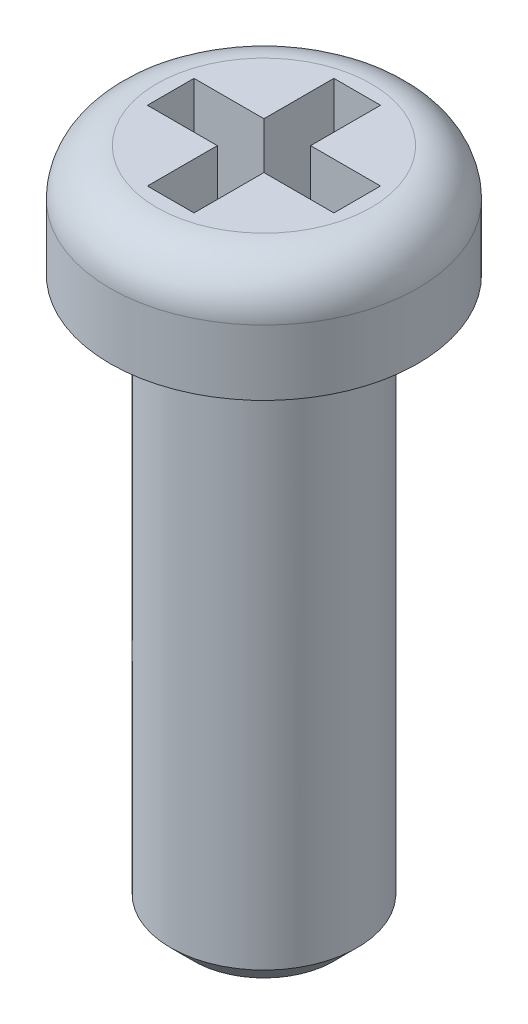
ISO-10303-21;
HEADER;
FILE_DESCRIPTION(('STEP AP214'),'2;1');
FILE_NAME('part.step','',(''),(''),'','','');
FILE_SCHEMA(('AUTOMOTIVE_DESIGN { 1 0 10303 214 1 1 1 1 }'));
ENDSEC;
DATA;
#1=APPLICATION_CONTEXT('core data for automotive mechanical design processes');
#2=APPLICATION_PROTOCOL_DEFINITION('international standard','automotive_design',2000,#1);
#3=PRODUCT_CONTEXT('',#1,'mechanical');
#4=PRODUCT('Part','Part','',(#3));
#5=PRODUCT_RELATED_PRODUCT_CATEGORY('part','',(#4));
#6=PRODUCT_DEFINITION_FORMATION('','',#4);
#7=PRODUCT_DEFINITION_CONTEXT('part definition',#1,'design');
#8=PRODUCT_DEFINITION('design','',#6,#7);
#9=PRODUCT_DEFINITION_SHAPE('','',#8);
#10=(LENGTH_UNIT() NAMED_UNIT(*) SI_UNIT(.MILLI.,.METRE.));
#11=(NAMED_UNIT(*) PLANE_ANGLE_UNIT() SI_UNIT($,.RADIAN.));
#12=(NAMED_UNIT(*) SI_UNIT($,.STERADIAN.) SOLID_ANGLE_UNIT());
#13=UNCERTAINTY_MEASURE_WITH_UNIT(LENGTH_MEASURE(1.E-05),#10,'distance_accuracy_value','');
#14=(GEOMETRIC_REPRESENTATION_CONTEXT(3) GLOBAL_UNCERTAINTY_ASSIGNED_CONTEXT((#13)) GLOBAL_UNIT_ASSIGNED_CONTEXT((#10,
#11,#12)) REPRESENTATION_CONTEXT('',''));
#15=CARTESIAN_POINT('',(0.,0.,0.));
#16=DIRECTION('',(0.,0.,1.));
#17=DIRECTION('',(1.,0.,0.));
#18=AXIS2_PLACEMENT_3D('',#15,#16,#17);
#19=CARTESIAN_POINT('',(1.64999999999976,0.,0.));
#20=DIRECTION('',(0.,1.,0.));
#21=DIRECTION('',(0.,0.,1.));
#22=AXIS2_PLACEMENT_3D('',#19,#20,#21);
#23=PLANE('',#22);
#24=CARTESIAN_POINT('',(0.,0.,0.));
#25=DIRECTION('',(0.,1.,0.));
#26=DIRECTION('',(0.,0.,1.));
#27=AXIS2_PLACEMENT_3D('',#24,#25,#26);
#28=CIRCLE('',#27,1.2);
#29=CARTESIAN_POINT('',(0.,0.,1.2));
#30=VERTEX_POINT('',#29);
#31=EDGE_CURVE('E222',#30,#30,#28,.T.);
#32=ORIENTED_EDGE('',*,*,#31,.T.);
#33=EDGE_LOOP('',(#32));
#34=FACE_BOUND('',#33,.T.);
#35=CARTESIAN_POINT('',(0.,0.,0.));
#36=DIRECTION('',(0.,1.,0.));
#37=DIRECTION('',(0.,0.,1.));
#38=AXIS2_PLACEMENT_3D('',#35,#36,#37);
#39=CIRCLE('',#38,1.65);
#40=CARTESIAN_POINT('',(0.,0.,1.65));
#41=VERTEX_POINT('',#40);
#42=EDGE_CURVE('E216',#41,#41,#39,.T.);
#43=ORIENTED_EDGE('',*,*,#42,.F.);
#44=EDGE_LOOP('',(#43));
#45=FACE_BOUND('',#44,.T.);
#46=ADVANCED_FACE('F44',(#34,#45),#23,.F.);
#47=CARTESIAN_POINT('',(0.249999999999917,0.199999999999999,1.00000000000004));
#48=DIRECTION('',(1.,0.,0.));
#49=DIRECTION('',(0.,0.,-1.));
#50=AXIS2_PLACEMENT_3D('',#47,#48,#49);
#51=PLANE('',#50);
#52=DIRECTION('',(0.,1.,0.));
#53=VECTOR('',#52,1.);
#54=CARTESIAN_POINT('',(0.249999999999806,0.199999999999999,0.250000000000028));
#55=LINE('',#54,#53);
#56=CARTESIAN_POINT('',(0.249999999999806,0.199999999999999,0.250000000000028));
#57=VERTEX_POINT('',#56);
#58=CARTESIAN_POINT('',(0.249999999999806,1.2,0.250000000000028));
#59=VERTEX_POINT('',#58);
#60=EDGE_CURVE('E166',#57,#59,#55,.T.);
#61=ORIENTED_EDGE('',*,*,#60,.F.);
#62=DIRECTION('',(0.,0.,-1.));
#63=VECTOR('',#62,1.);
#64=CARTESIAN_POINT('',(0.249999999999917,0.199999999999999,1.00000000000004));
#65=LINE('',#64,#63);
#66=CARTESIAN_POINT('',(0.249999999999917,0.199999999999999,1.00000000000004));
#67=VERTEX_POINT('',#66);
#68=EDGE_CURVE('E175',#67,#57,#65,.T.);
#69=ORIENTED_EDGE('',*,*,#68,.F.);
#70=DIRECTION('',(0.,1.,0.));
#71=VECTOR('',#70,1.);
#72=CARTESIAN_POINT('',(0.249999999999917,0.199999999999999,1.00000000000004));
#73=LINE('',#72,#71);
#74=CARTESIAN_POINT('',(0.249999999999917,1.2,1.00000000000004));
#75=VERTEX_POINT('',#74);
#76=EDGE_CURVE('E201',#67,#75,#73,.T.);
#77=ORIENTED_EDGE('',*,*,#76,.T.);
#78=DIRECTION('',(0.,0.,-1.));
#79=VECTOR('',#78,1.);
#80=CARTESIAN_POINT('',(0.249999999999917,1.2,1.00000000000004));
#81=LINE('',#80,#79);
#82=EDGE_CURVE('E188',#75,#59,#81,.T.);
#83=ORIENTED_EDGE('',*,*,#82,.T.);
#84=EDGE_LOOP('',(#61,#69,#77,#83));
#85=FACE_BOUND('',#84,.T.);
#86=ADVANCED_FACE('F238',(#85),#51,.F.);
#87=CARTESIAN_POINT('',(-0.250000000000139,0.199999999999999,1.00000000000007));
#88=DIRECTION('',(1.,0.,0.));
#89=DIRECTION('',(0.,0.,-1.));
#90=AXIS2_PLACEMENT_3D('',#87,#88,#89);
#91=PLANE('',#90);
#92=DIRECTION('',(0.,0.,-1.));
#93=VECTOR('',#92,1.);
#94=CARTESIAN_POINT('',(-0.250000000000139,0.199999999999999,1.00000000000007));
#95=LINE('',#94,#93);
#96=CARTESIAN_POINT('',(-0.250000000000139,0.199999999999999,1.00000000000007));
#97=VERTEX_POINT('',#96);
#98=CARTESIAN_POINT('',(-0.250000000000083,0.199999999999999,0.25000000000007));
#99=VERTEX_POINT('',#98);
#100=EDGE_CURVE('E182',#97,#99,#95,.T.);
#101=ORIENTED_EDGE('',*,*,#100,.T.);
#102=DIRECTION('',(0.,1.,0.));
#103=VECTOR('',#102,1.);
#104=CARTESIAN_POINT('',(-0.250000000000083,0.199999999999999,0.25000000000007));
#105=LINE('',#104,#103);
#106=CARTESIAN_POINT('',(-0.250000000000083,1.2,0.25000000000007));
#107=VERTEX_POINT('',#106);
#108=EDGE_CURVE('E163',#99,#107,#105,.T.);
#109=ORIENTED_EDGE('',*,*,#108,.T.);
#110=DIRECTION('',(0.,0.,-1.));
#111=VECTOR('',#110,1.);
#112=CARTESIAN_POINT('',(-0.250000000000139,1.2,1.00000000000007));
#113=LINE('',#112,#111);
#114=CARTESIAN_POINT('',(-0.250000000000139,1.2,1.00000000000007));
#115=VERTEX_POINT('',#114);
#116=EDGE_CURVE('E195',#115,#107,#113,.T.);
#117=ORIENTED_EDGE('',*,*,#116,.F.);
#118=DIRECTION('',(0.,1.,0.));
#119=VECTOR('',#118,1.);
#120=CARTESIAN_POINT('',(-0.250000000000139,0.199999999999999,1.00000000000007));
#121=LINE('',#120,#119);
#122=EDGE_CURVE('E204',#97,#115,#121,.T.);
#123=ORIENTED_EDGE('',*,*,#122,.F.);
#124=EDGE_LOOP('',(#101,#109,#117,#123));
#125=FACE_BOUND('',#124,.T.);
#126=ADVANCED_FACE('F244',(#125),#91,.T.);
#127=CARTESIAN_POINT('',(0.,11.592517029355,0.));
#128=DIRECTION('',(0.,1.,0.));
#129=DIRECTION('',(0.,0.,1.));
#130=AXIS2_PLACEMENT_3D('',#127,#128,#129);
#131=CYLINDRICAL_SURFACE('',#130,1.65);
#132=CARTESIAN_POINT('',(0.,0.699999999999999,0.));
#133=DIRECTION('',(0.,1.,0.));
#134=DIRECTION('',(0.,0.,1.));
#135=AXIS2_PLACEMENT_3D('',#132,#133,#134);
#136=CIRCLE('',#135,1.65);
#137=CARTESIAN_POINT('',(0.,0.699999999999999,1.65));
#138=VERTEX_POINT('',#137);
#139=EDGE_CURVE('E213',#138,#138,#136,.T.);
#140=ORIENTED_EDGE('',*,*,#139,.F.);
#141=EDGE_LOOP('',(#140));
#142=FACE_BOUND('',#141,.T.);
#143=ORIENTED_EDGE('',*,*,#42,.T.);
#144=EDGE_LOOP('',(#143));
#145=FACE_BOUND('',#144,.T.);
#146=ADVANCED_FACE('F250',(#142,#145),#131,.T.);
#147=CARTESIAN_POINT('',(0.,0.699999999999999,0.));
#148=DIRECTION('',(0.,1.,0.));
#149=DIRECTION('',(0.,0.,1.));
#150=AXIS2_PLACEMENT_3D('',#147,#148,#149);
#151=TOROIDAL_SURFACE('',#150,1.15,0.5);
#152=CARTESIAN_POINT('',(0.,1.2,0.));
#153=DIRECTION('',(0.,1.,0.));
#154=DIRECTION('',(0.,0.,1.));
#155=AXIS2_PLACEMENT_3D('',#152,#153,#154);
#156=CIRCLE('',#155,1.15);
#157=CARTESIAN_POINT('',(0.,1.2,1.15));
#158=VERTEX_POINT('',#157);
#159=EDGE_CURVE('E203',#158,#158,#156,.T.);
#160=ORIENTED_EDGE('',*,*,#159,.F.);
#161=EDGE_LOOP('',(#160));
#162=FACE_BOUND('',#161,.T.);
#163=ORIENTED_EDGE('',*,*,#139,.T.);
#164=EDGE_LOOP('',(#163));
#165=FACE_BOUND('',#164,.T.);
#166=ADVANCED_FACE('F253',(#162,#165),#151,.T.);
#167=CARTESIAN_POINT('',(0.,1.2,0.));
#168=DIRECTION('',(0.,-1.,0.));
#169=DIRECTION('',(0.,0.,-1.));
#170=AXIS2_PLACEMENT_3D('',#167,#168,#169);
#171=PLANE('',#170);
#172=CARTESIAN_POINT('',(0.24999999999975,1.2,-0.249999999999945));
#173=VERTEX_POINT('',#172);
#174=CARTESIAN_POINT('',(0.249999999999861,1.2,-0.999999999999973));
#175=VERTEX_POINT('',#174);
#176=EDGE_CURVE('E174',#173,#175,#81,.T.);
#177=ORIENTED_EDGE('',*,*,#176,.F.);
#178=DIRECTION('',(-1.,0.,0.));
#179=VECTOR('',#178,1.);
#180=CARTESIAN_POINT('',(0.999999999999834,1.2,-0.25));
#181=LINE('',#180,#179);
#182=CARTESIAN_POINT('',(0.999999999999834,1.2,-0.25));
#183=VERTEX_POINT('',#182);
#184=EDGE_CURVE('E410',#183,#173,#181,.T.);
#185=ORIENTED_EDGE('',*,*,#184,.F.);
#186=DIRECTION('',(0.,0.,1.));
#187=VECTOR('',#186,1.);
#188=CARTESIAN_POINT('',(0.999999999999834,1.2,-0.25));
#189=LINE('',#188,#187);
#190=CARTESIAN_POINT('',(0.999999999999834,1.2,0.250000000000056));
#191=VERTEX_POINT('',#190);
#192=EDGE_CURVE('E141',#183,#191,#189,.T.);
#193=ORIENTED_EDGE('',*,*,#192,.T.);
#194=DIRECTION('',(-1.,0.,0.));
#195=VECTOR('',#194,1.);
#196=CARTESIAN_POINT('',(0.999999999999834,1.2,0.250000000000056));
#197=LINE('',#196,#195);
#198=EDGE_CURVE('E395',#191,#59,#197,.T.);
#199=ORIENTED_EDGE('',*,*,#198,.T.);
#200=ORIENTED_EDGE('',*,*,#82,.F.);
#201=DIRECTION('',(-1.,0.,0.));
#202=VECTOR('',#201,1.);
#203=CARTESIAN_POINT('',(0.249999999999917,1.2,1.00000000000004));
#204=LINE('',#203,#202);
#205=EDGE_CURVE('E198',#75,#115,#204,.T.);
#206=ORIENTED_EDGE('',*,*,#205,.T.);
#207=ORIENTED_EDGE('',*,*,#116,.T.);
#208=CARTESIAN_POINT('',(-1.00000000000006,1.2,0.250000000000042));
#209=VERTEX_POINT('',#208);
#210=EDGE_CURVE('E401',#107,#209,#197,.T.);
#211=ORIENTED_EDGE('',*,*,#210,.T.);
#212=DIRECTION('',(0.,0.,-1.));
#213=VECTOR('',#212,1.);
#214=CARTESIAN_POINT('',(-1.00000000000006,1.2,0.250000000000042));
#215=LINE('',#214,#213);
#216=CARTESIAN_POINT('',(-1.00000000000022,1.2,-0.250000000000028));
#217=VERTEX_POINT('',#216);
#218=EDGE_CURVE('E405',#209,#217,#215,.T.);
#219=ORIENTED_EDGE('',*,*,#218,.T.);
#220=CARTESIAN_POINT('',(-0.25000000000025,1.2,-0.249999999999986));
#221=VERTEX_POINT('',#220);
#222=EDGE_CURVE('E154',#221,#217,#181,.T.);
#223=ORIENTED_EDGE('',*,*,#222,.F.);
#224=CARTESIAN_POINT('',(-0.250000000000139,1.2,-0.999999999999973));
#225=VERTEX_POINT('',#224);
#226=EDGE_CURVE('E194',#221,#225,#113,.T.);
#227=ORIENTED_EDGE('',*,*,#226,.T.);
#228=DIRECTION('',(1.,0.,0.));
#229=VECTOR('',#228,1.);
#230=CARTESIAN_POINT('',(-0.250000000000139,1.2,-0.999999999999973));
#231=LINE('',#230,#229);
#232=EDGE_CURVE('E191',#225,#175,#231,.T.);
#233=ORIENTED_EDGE('',*,*,#232,.T.);
#234=EDGE_LOOP('',(#177,#185,#193,#199,#200,#206,#207,#211,#219,#223,#227,#233));
#235=FACE_BOUND('',#234,.T.);
#236=ORIENTED_EDGE('',*,*,#159,.T.);
#237=EDGE_LOOP('',(#236));
#238=FACE_BOUND('',#237,.T.);
#239=ADVANCED_FACE('F257',(#235,#238),#171,.F.);
#240=CARTESIAN_POINT('',(0.24999999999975,0.199999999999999,-0.249999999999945));
#241=VERTEX_POINT('',#240);
#242=CARTESIAN_POINT('',(0.249999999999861,0.199999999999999,-0.999999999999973));
#243=VERTEX_POINT('',#242);
#244=EDGE_CURVE('E179',#241,#243,#65,.T.);
#245=ORIENTED_EDGE('',*,*,#244,.F.);
#246=DIRECTION('',(0.,1.,0.));
#247=VECTOR('',#246,1.);
#248=CARTESIAN_POINT('',(0.24999999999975,0.199999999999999,-0.249999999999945));
#249=LINE('',#248,#247);
#250=EDGE_CURVE('E171',#241,#173,#249,.T.);
#251=ORIENTED_EDGE('',*,*,#250,.T.);
#252=ORIENTED_EDGE('',*,*,#176,.T.);
#253=DIRECTION('',(0.,1.,0.));
#254=VECTOR('',#253,1.);
#255=CARTESIAN_POINT('',(0.249999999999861,0.199999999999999,-0.999999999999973));
#256=LINE('',#255,#254);
#257=EDGE_CURVE('E187',#243,#175,#256,.T.);
#258=ORIENTED_EDGE('',*,*,#257,.F.);
#259=EDGE_LOOP('',(#245,#251,#252,#258));
#260=FACE_BOUND('',#259,.T.);
#261=ADVANCED_FACE('F247',(#260),#51,.F.);
#262=CARTESIAN_POINT('',(0.249999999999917,0.199999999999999,1.00000000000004));
#263=DIRECTION('',(0.,0.,-1.));
#264=DIRECTION('',(-1.,0.,0.));
#265=AXIS2_PLACEMENT_3D('',#262,#263,#264);
#266=PLANE('',#265);
#267=ORIENTED_EDGE('',*,*,#205,.F.);
#268=ORIENTED_EDGE('',*,*,#76,.F.);
#269=DIRECTION('',(-1.,0.,0.));
#270=VECTOR('',#269,1.);
#271=CARTESIAN_POINT('',(0.249999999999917,0.199999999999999,1.00000000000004));
#272=LINE('',#271,#270);
#273=EDGE_CURVE('E185',#67,#97,#272,.T.);
#274=ORIENTED_EDGE('',*,*,#273,.T.);
#275=ORIENTED_EDGE('',*,*,#122,.T.);
#276=EDGE_LOOP('',(#267,#268,#274,#275));
#277=FACE_BOUND('',#276,.T.);
#278=ADVANCED_FACE('F263',(#277),#266,.T.);
#279=DIRECTION('',(0.,1.,0.));
#280=VECTOR('',#279,1.);
#281=CARTESIAN_POINT('',(-0.25000000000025,0.199999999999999,-0.249999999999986));
#282=LINE('',#281,#280);
#283=CARTESIAN_POINT('',(-0.25000000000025,0.199999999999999,-0.249999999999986));
#284=VERTEX_POINT('',#283);
#285=EDGE_CURVE('E169',#284,#221,#282,.T.);
#286=ORIENTED_EDGE('',*,*,#285,.F.);
#287=CARTESIAN_POINT('',(-0.250000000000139,0.199999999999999,-0.999999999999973));
#288=VERTEX_POINT('',#287);
#289=EDGE_CURVE('E137',#284,#288,#95,.T.);
#290=ORIENTED_EDGE('',*,*,#289,.T.);
#291=DIRECTION('',(0.,1.,0.));
#292=VECTOR('',#291,1.);
#293=CARTESIAN_POINT('',(-0.250000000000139,0.199999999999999,-0.999999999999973));
#294=LINE('',#293,#292);
#295=EDGE_CURVE('E206',#288,#225,#294,.T.);
#296=ORIENTED_EDGE('',*,*,#295,.T.);
#297=ORIENTED_EDGE('',*,*,#226,.F.);
#298=EDGE_LOOP('',(#286,#290,#296,#297));
#299=FACE_BOUND('',#298,.T.);
#300=ADVANCED_FACE('F268',(#299),#91,.T.);
#301=CARTESIAN_POINT('',(-0.250000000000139,0.199999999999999,-0.999999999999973));
#302=DIRECTION('',(0.,0.,1.));
#303=DIRECTION('',(1.,0.,0.));
#304=AXIS2_PLACEMENT_3D('',#301,#302,#303);
#305=PLANE('',#304);
#306=ORIENTED_EDGE('',*,*,#232,.F.);
#307=ORIENTED_EDGE('',*,*,#295,.F.);
#308=DIRECTION('',(1.,0.,0.));
#309=VECTOR('',#308,1.);
#310=CARTESIAN_POINT('',(-0.250000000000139,0.199999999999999,-0.999999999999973));
#311=LINE('',#310,#309);
#312=EDGE_CURVE('E178',#288,#243,#311,.T.);
#313=ORIENTED_EDGE('',*,*,#312,.T.);
#314=ORIENTED_EDGE('',*,*,#257,.T.);
#315=EDGE_LOOP('',(#306,#307,#313,#314));
#316=FACE_BOUND('',#315,.T.);
#317=ADVANCED_FACE('F265',(#316),#305,.T.);
#318=CARTESIAN_POINT('',(0.249999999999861,0.199999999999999,-0.999999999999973));
#319=DIRECTION('',(0.,-1.,0.));
#320=DIRECTION('',(0.,0.,-1.));
#321=AXIS2_PLACEMENT_3D('',#318,#319,#320);
#322=PLANE('',#321);
#323=ORIENTED_EDGE('',*,*,#289,.F.);
#324=DIRECTION('',(-1.,0.,0.));
#325=VECTOR('',#324,1.);
#326=CARTESIAN_POINT('',(0.999999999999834,0.199999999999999,-0.25));
#327=LINE('',#326,#325);
#328=CARTESIAN_POINT('',(-1.00000000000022,0.199999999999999,-0.250000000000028));
#329=VERTEX_POINT('',#328);
#330=EDGE_CURVE('E132',#284,#329,#327,.T.);
#331=ORIENTED_EDGE('',*,*,#330,.T.);
#332=DIRECTION('',(0.,0.,-1.));
#333=VECTOR('',#332,1.);
#334=CARTESIAN_POINT('',(-1.00000000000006,0.199999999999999,0.250000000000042));
#335=LINE('',#334,#333);
#336=CARTESIAN_POINT('',(-1.00000000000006,0.199999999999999,0.250000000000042));
#337=VERTEX_POINT('',#336);
#338=EDGE_CURVE('E135',#337,#329,#335,.T.);
#339=ORIENTED_EDGE('',*,*,#338,.F.);
#340=DIRECTION('',(-1.,0.,0.));
#341=VECTOR('',#340,1.);
#342=CARTESIAN_POINT('',(0.999999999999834,0.199999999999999,0.250000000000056));
#343=LINE('',#342,#341);
#344=EDGE_CURVE('E59',#99,#337,#343,.T.);
#345=ORIENTED_EDGE('',*,*,#344,.F.);
#346=ORIENTED_EDGE('',*,*,#100,.F.);
#347=ORIENTED_EDGE('',*,*,#273,.F.);
#348=ORIENTED_EDGE('',*,*,#68,.T.);
#349=CARTESIAN_POINT('',(0.999999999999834,0.199999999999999,0.250000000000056));
#350=VERTEX_POINT('',#349);
#351=EDGE_CURVE('E159',#350,#57,#343,.T.);
#352=ORIENTED_EDGE('',*,*,#351,.F.);
#353=DIRECTION('',(0.,0.,1.));
#354=VECTOR('',#353,1.);
#355=CARTESIAN_POINT('',(0.999999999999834,0.199999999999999,-0.25));
#356=LINE('',#355,#354);
#357=CARTESIAN_POINT('',(0.999999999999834,0.199999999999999,-0.25));
#358=VERTEX_POINT('',#357);
#359=EDGE_CURVE('E155',#358,#350,#356,.T.);
#360=ORIENTED_EDGE('',*,*,#359,.F.);
#361=EDGE_CURVE('E66',#358,#241,#327,.T.);
#362=ORIENTED_EDGE('',*,*,#361,.T.);
#363=ORIENTED_EDGE('',*,*,#244,.T.);
#364=ORIENTED_EDGE('',*,*,#312,.F.);
#365=EDGE_LOOP('',(#323,#331,#339,#345,#346,#347,#348,#352,#360,#362,#363,#364));
#366=FACE_BOUND('',#365,.T.);
#367=ADVANCED_FACE('F134',(#366),#322,.F.);
#368=CARTESIAN_POINT('',(0.999999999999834,0.199999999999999,0.250000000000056));
#369=DIRECTION('',(0.,0.,-1.));
#370=DIRECTION('',(-1.,0.,0.));
#371=AXIS2_PLACEMENT_3D('',#368,#369,#370);
#372=PLANE('',#371);
#373=ORIENTED_EDGE('',*,*,#344,.T.);
#374=DIRECTION('',(0.,1.,0.));
#375=VECTOR('',#374,1.);
#376=CARTESIAN_POINT('',(-1.00000000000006,0.199999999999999,0.250000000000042));
#377=LINE('',#376,#375);
#378=EDGE_CURVE('E150',#337,#209,#377,.T.);
#379=ORIENTED_EDGE('',*,*,#378,.T.);
#380=ORIENTED_EDGE('',*,*,#210,.F.);
#381=ORIENTED_EDGE('',*,*,#108,.F.);
#382=EDGE_LOOP('',(#373,#379,#380,#381));
#383=FACE_BOUND('',#382,.T.);
#384=ADVANCED_FACE('F278',(#383),#372,.T.);
#385=CARTESIAN_POINT('',(0.999999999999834,0.199999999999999,-0.25));
#386=DIRECTION('',(0.,0.,-1.));
#387=DIRECTION('',(-1.,0.,0.));
#388=AXIS2_PLACEMENT_3D('',#385,#386,#387);
#389=PLANE('',#388);
#390=ORIENTED_EDGE('',*,*,#285,.T.);
#391=ORIENTED_EDGE('',*,*,#222,.T.);
#392=DIRECTION('',(0.,1.,0.));
#393=VECTOR('',#392,1.);
#394=CARTESIAN_POINT('',(-1.00000000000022,0.199999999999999,-0.250000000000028));
#395=LINE('',#394,#393);
#396=EDGE_CURVE('E148',#329,#217,#395,.T.);
#397=ORIENTED_EDGE('',*,*,#396,.F.);
#398=ORIENTED_EDGE('',*,*,#330,.F.);
#399=EDGE_LOOP('',(#390,#391,#397,#398));
#400=FACE_BOUND('',#399,.T.);
#401=ADVANCED_FACE('F152',(#400),#389,.F.);
#402=CARTESIAN_POINT('',(-1.00000000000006,0.199999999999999,0.250000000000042));
#403=DIRECTION('',(1.,0.,0.));
#404=DIRECTION('',(0.,0.,-1.));
#405=AXIS2_PLACEMENT_3D('',#402,#403,#404);
#406=PLANE('',#405);
#407=ORIENTED_EDGE('',*,*,#218,.F.);
#408=ORIENTED_EDGE('',*,*,#378,.F.);
#409=ORIENTED_EDGE('',*,*,#338,.T.);
#410=ORIENTED_EDGE('',*,*,#396,.T.);
#411=EDGE_LOOP('',(#407,#408,#409,#410));
#412=FACE_BOUND('',#411,.T.);
#413=ADVANCED_FACE('F147',(#412),#406,.T.);
#414=ORIENTED_EDGE('',*,*,#361,.F.);
#415=DIRECTION('',(0.,1.,0.));
#416=VECTOR('',#415,1.);
#417=CARTESIAN_POINT('',(0.999999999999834,0.199999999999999,-0.25));
#418=LINE('',#417,#416);
#419=EDGE_CURVE('E167',#358,#183,#418,.T.);
#420=ORIENTED_EDGE('',*,*,#419,.T.);
#421=ORIENTED_EDGE('',*,*,#184,.T.);
#422=ORIENTED_EDGE('',*,*,#250,.F.);
#423=EDGE_LOOP('',(#414,#420,#421,#422));
#424=FACE_BOUND('',#423,.T.);
#425=ADVANCED_FACE('F281',(#424),#389,.F.);
#426=ORIENTED_EDGE('',*,*,#60,.T.);
#427=ORIENTED_EDGE('',*,*,#198,.F.);
#428=DIRECTION('',(0.,1.,0.));
#429=VECTOR('',#428,1.);
#430=CARTESIAN_POINT('',(0.999999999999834,0.199999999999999,0.250000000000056));
#431=LINE('',#430,#429);
#432=EDGE_CURVE('E157',#350,#191,#431,.T.);
#433=ORIENTED_EDGE('',*,*,#432,.F.);
#434=ORIENTED_EDGE('',*,*,#351,.T.);
#435=EDGE_LOOP('',(#426,#427,#433,#434));
#436=FACE_BOUND('',#435,.T.);
#437=ADVANCED_FACE('F287',(#436),#372,.T.);
#438=CARTESIAN_POINT('',(0.999999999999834,0.199999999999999,-0.25));
#439=DIRECTION('',(-1.,0.,0.));
#440=DIRECTION('',(0.,0.,1.));
#441=AXIS2_PLACEMENT_3D('',#438,#439,#440);
#442=PLANE('',#441);
#443=ORIENTED_EDGE('',*,*,#192,.F.);
#444=ORIENTED_EDGE('',*,*,#419,.F.);
#445=ORIENTED_EDGE('',*,*,#359,.T.);
#446=ORIENTED_EDGE('',*,*,#432,.T.);
#447=EDGE_LOOP('',(#443,#444,#445,#446));
#448=FACE_BOUND('',#447,.T.);
#449=ADVANCED_FACE('F288',(#448),#442,.T.);
#450=CARTESIAN_POINT('',(0.,-6.,0.));
#451=DIRECTION('',(0.,1.,0.));
#452=DIRECTION('',(0.,0.,1.));
#453=AXIS2_PLACEMENT_3D('',#450,#451,#452);
#454=CYLINDRICAL_SURFACE('',#453,1.);
#455=CARTESIAN_POINT('',(0.,-5.75,0.));
#456=DIRECTION('',(0.,-1.,0.));
#457=DIRECTION('',(0.,0.,-1.));
#458=AXIS2_PLACEMENT_3D('',#455,#456,#457);
#459=CIRCLE('',#458,1.);
#460=CARTESIAN_POINT('',(0.,-5.75,-1.));
#461=VERTEX_POINT('',#460);
#462=EDGE_CURVE('E13',#461,#461,#459,.F.);
#463=ORIENTED_EDGE('',*,*,#462,.T.);
#464=EDGE_LOOP('',(#463));
#465=FACE_BOUND('',#464,.T.);
#466=CARTESIAN_POINT('',(0.,-0.199999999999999,0.));
#467=DIRECTION('',(0.,1.,0.));
#468=DIRECTION('',(0.,0.,1.));
#469=AXIS2_PLACEMENT_3D('',#466,#467,#468);
#470=CIRCLE('',#469,1.);
#471=CARTESIAN_POINT('',(0.,-0.199999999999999,1.));
#472=VERTEX_POINT('',#471);
#473=EDGE_CURVE('E219',#472,#472,#470,.F.);
#474=ORIENTED_EDGE('',*,*,#473,.T.);
#475=EDGE_LOOP('',(#474));
#476=FACE_BOUND('',#475,.T.);
#477=ADVANCED_FACE('F291',(#465,#476),#454,.T.);
#478=CARTESIAN_POINT('',(0.,-6.,0.));
#479=DIRECTION('',(0.,-1.,0.));
#480=DIRECTION('',(0.,0.,-1.));
#481=AXIS2_PLACEMENT_3D('',#478,#479,#480);
#482=PLANE('',#481);
#483=CARTESIAN_POINT('',(0.,-6.,0.));
#484=DIRECTION('',(0.,-1.,0.));
#485=DIRECTION('',(0.,0.,-1.));
#486=AXIS2_PLACEMENT_3D('',#483,#484,#485);
#487=CIRCLE('',#486,0.75);
#488=CARTESIAN_POINT('',(0.,-6.,-0.750000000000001));
#489=VERTEX_POINT('',#488);
#490=EDGE_CURVE('E52',#489,#489,#487,.T.);
#491=ORIENTED_EDGE('',*,*,#490,.T.);
#492=EDGE_LOOP('',(#491));
#493=FACE_BOUND('',#492,.T.);
#494=ADVANCED_FACE('F227',(#493),#482,.T.);
#495=CARTESIAN_POINT('',(0.,-0.199999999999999,0.));
#496=DIRECTION('',(0.,1.,0.));
#497=DIRECTION('',(0.,0.,1.));
#498=AXIS2_PLACEMENT_3D('',#495,#496,#497);
#499=TOROIDAL_SURFACE('',#498,1.2,0.2);
#500=ORIENTED_EDGE('',*,*,#31,.F.);
#501=EDGE_LOOP('',(#500));
#502=FACE_BOUND('',#501,.T.);
#503=ORIENTED_EDGE('',*,*,#473,.F.);
#504=EDGE_LOOP('',(#503));
#505=FACE_BOUND('',#504,.T.);
#506=ADVANCED_FACE('F230',(#502,#505),#499,.F.);
#507=CARTESIAN_POINT('',(0.,-6.,0.));
#508=DIRECTION('',(0.,1.,0.));
#509=DIRECTION('',(0.,0.,1.));
#510=AXIS2_PLACEMENT_3D('',#507,#508,#509);
#511=CONICAL_SURFACE('',#510,0.75,0.785398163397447);
#512=ORIENTED_EDGE('',*,*,#462,.F.);
#513=EDGE_LOOP('',(#512));
#514=FACE_BOUND('',#513,.T.);
#515=ORIENTED_EDGE('',*,*,#490,.F.);
#516=EDGE_LOOP('',(#515));
#517=FACE_BOUND('',#516,.T.);
#518=ADVANCED_FACE('F46',(#514,#517),#511,.T.);
#519=CLOSED_SHELL('',(#46,#86,#126,#146,#166,#239,#261,#278,#300,#317,#367,#384,#401,#413,#425,
#437,#449,#477,#494,#506,#518));
#520=MANIFOLD_SOLID_BREP('B2',#519);
#521=ADVANCED_BREP_SHAPE_REPRESENTATION('',(#18,#520),#14);
#522=SHAPE_DEFINITION_REPRESENTATION(#9,#521);
ENDSEC;
END-ISO-10303-21;
